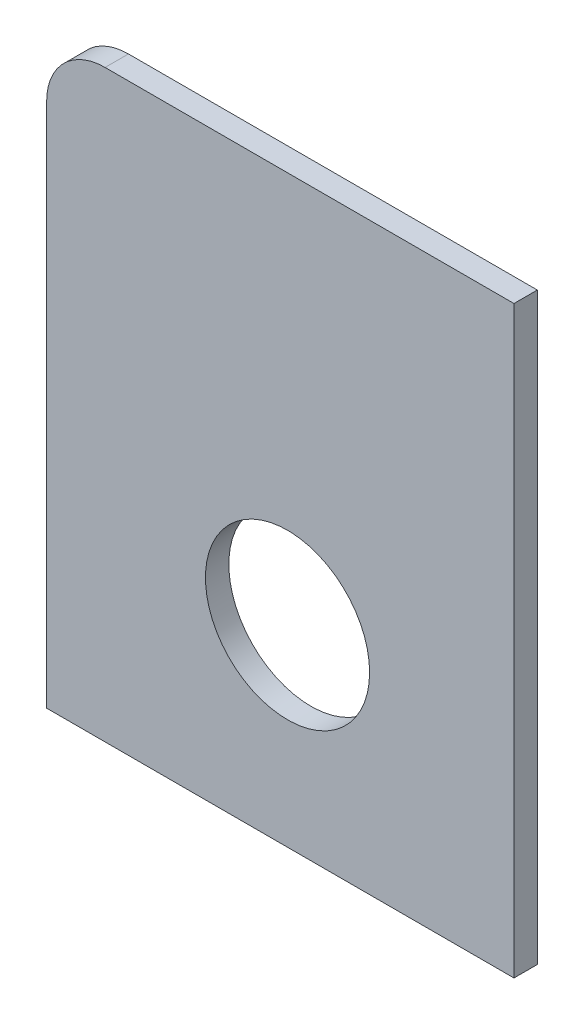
ISO-10303-21;
HEADER;
FILE_DESCRIPTION(('STEP AP214'),'2;1');
FILE_NAME('part.step','',(''),(''),'','','');
FILE_SCHEMA(('AUTOMOTIVE_DESIGN { 1 0 10303 214 1 1 1 1 }'));
ENDSEC;
DATA;
#1=APPLICATION_CONTEXT('core data for automotive mechanical design processes');
#2=APPLICATION_PROTOCOL_DEFINITION('international standard','automotive_design',2000,#1);
#3=PRODUCT_CONTEXT('',#1,'mechanical');
#4=PRODUCT('Part','Part','',(#3));
#5=PRODUCT_RELATED_PRODUCT_CATEGORY('part','',(#4));
#6=PRODUCT_DEFINITION_FORMATION('','',#4);
#7=PRODUCT_DEFINITION_CONTEXT('part definition',#1,'design');
#8=PRODUCT_DEFINITION('design','',#6,#7);
#9=PRODUCT_DEFINITION_SHAPE('','',#8);
#10=(LENGTH_UNIT() NAMED_UNIT(*) SI_UNIT(.MILLI.,.METRE.));
#11=(NAMED_UNIT(*) PLANE_ANGLE_UNIT() SI_UNIT($,.RADIAN.));
#12=(NAMED_UNIT(*) SI_UNIT($,.STERADIAN.) SOLID_ANGLE_UNIT());
#13=UNCERTAINTY_MEASURE_WITH_UNIT(LENGTH_MEASURE(1.E-05),#10,'distance_accuracy_value','');
#14=(GEOMETRIC_REPRESENTATION_CONTEXT(3) GLOBAL_UNCERTAINTY_ASSIGNED_CONTEXT((#13)) GLOBAL_UNIT_ASSIGNED_CONTEXT((#10,
#11,#12)) REPRESENTATION_CONTEXT('',''));
#15=CARTESIAN_POINT('',(0.,0.,0.));
#16=DIRECTION('',(0.,0.,1.));
#17=DIRECTION('',(1.,0.,0.));
#18=AXIS2_PLACEMENT_3D('',#15,#16,#17);
#19=CARTESIAN_POINT('',(-44.45,57.15,2.54));
#20=DIRECTION('',(0.,0.,1.));
#21=DIRECTION('',(1.,0.,0.));
#22=AXIS2_PLACEMENT_3D('',#19,#20,#21);
#23=PLANE('',#22);
#24=DIRECTION('',(0.,1.,0.));
#25=VECTOR('',#24,1.);
#26=CARTESIAN_POINT('',(0.,0.,2.54));
#27=LINE('',#26,#25);
#28=CARTESIAN_POINT('',(0.,0.,2.54));
#29=VERTEX_POINT('',#28);
#30=CARTESIAN_POINT('',(0.,63.5,2.54));
#31=VERTEX_POINT('',#30);
#32=EDGE_CURVE('E104',#29,#31,#27,.T.);
#33=ORIENTED_EDGE('',*,*,#32,.T.);
#34=DIRECTION('',(-1.,0.,0.));
#35=VECTOR('',#34,1.);
#36=CARTESIAN_POINT('',(0.,63.5,2.54));
#37=LINE('',#36,#35);
#38=CARTESIAN_POINT('',(-44.45,63.5,2.54));
#39=VERTEX_POINT('',#38);
#40=EDGE_CURVE('E87',#31,#39,#37,.T.);
#41=ORIENTED_EDGE('',*,*,#40,.T.);
#42=CARTESIAN_POINT('',(-44.45,57.15,2.54));
#43=DIRECTION('',(0.,0.,1.));
#44=DIRECTION('',(1.,0.,0.));
#45=AXIS2_PLACEMENT_3D('',#42,#43,#44);
#46=CIRCLE('',#45,6.35000000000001);
#47=CARTESIAN_POINT('',(-50.8,57.15,2.54));
#48=VERTEX_POINT('',#47);
#49=EDGE_CURVE('E107',#39,#48,#46,.T.);
#50=ORIENTED_EDGE('',*,*,#49,.T.);
#51=DIRECTION('',(0.,-1.,0.));
#52=VECTOR('',#51,1.);
#53=CARTESIAN_POINT('',(-50.8,0.,2.54));
#54=LINE('',#53,#52);
#55=CARTESIAN_POINT('',(-50.8,0.,2.54));
#56=VERTEX_POINT('',#55);
#57=EDGE_CURVE('E46',#48,#56,#54,.T.);
#58=ORIENTED_EDGE('',*,*,#57,.T.);
#59=DIRECTION('',(1.,0.,0.));
#60=VECTOR('',#59,1.);
#61=CARTESIAN_POINT('',(0.,0.,2.54));
#62=LINE('',#61,#60);
#63=EDGE_CURVE('E41',#56,#29,#62,.T.);
#64=ORIENTED_EDGE('',*,*,#63,.T.);
#65=EDGE_LOOP('',(#33,#41,#50,#58,#64));
#66=FACE_BOUND('',#65,.T.);
#67=CARTESIAN_POINT('',(-24.6167400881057,20.9242290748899,2.54));
#68=DIRECTION('',(0.,0.,1.));
#69=DIRECTION('',(1.,0.,0.));
#70=AXIS2_PLACEMENT_3D('',#67,#68,#69);
#71=CIRCLE('',#70,8.92356828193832);
#72=CARTESIAN_POINT('',(-15.6931718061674,20.9242290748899,2.54));
#73=VERTEX_POINT('',#72);
#74=EDGE_CURVE('E92',#73,#73,#71,.T.);
#75=ORIENTED_EDGE('',*,*,#74,.F.);
#76=EDGE_LOOP('',(#75));
#77=FACE_BOUND('',#76,.T.);
#78=ADVANCED_FACE('F26',(#66,#77),#23,.T.);
#79=CARTESIAN_POINT('',(-44.45,57.15,0.));
#80=DIRECTION('',(0.,0.,1.));
#81=DIRECTION('',(1.,0.,0.));
#82=AXIS2_PLACEMENT_3D('',#79,#80,#81);
#83=PLANE('',#82);
#84=DIRECTION('',(0.,1.,0.));
#85=VECTOR('',#84,1.);
#86=CARTESIAN_POINT('',(0.,0.,0.));
#87=LINE('',#86,#85);
#88=CARTESIAN_POINT('',(0.,0.,0.));
#89=VERTEX_POINT('',#88);
#90=CARTESIAN_POINT('',(0.,63.5,0.));
#91=VERTEX_POINT('',#90);
#92=EDGE_CURVE('E78',#89,#91,#87,.T.);
#93=ORIENTED_EDGE('',*,*,#92,.F.);
#94=DIRECTION('',(1.,0.,0.));
#95=VECTOR('',#94,1.);
#96=CARTESIAN_POINT('',(0.,0.,0.));
#97=LINE('',#96,#95);
#98=CARTESIAN_POINT('',(-50.8,0.,0.));
#99=VERTEX_POINT('',#98);
#100=EDGE_CURVE('E102',#99,#89,#97,.T.);
#101=ORIENTED_EDGE('',*,*,#100,.F.);
#102=DIRECTION('',(0.,-1.,0.));
#103=VECTOR('',#102,1.);
#104=CARTESIAN_POINT('',(-50.8,0.,0.));
#105=LINE('',#104,#103);
#106=CARTESIAN_POINT('',(-50.8,57.15,0.));
#107=VERTEX_POINT('',#106);
#108=EDGE_CURVE('E100',#107,#99,#105,.T.);
#109=ORIENTED_EDGE('',*,*,#108,.F.);
#110=CARTESIAN_POINT('',(-44.45,57.15,0.));
#111=DIRECTION('',(0.,0.,1.));
#112=DIRECTION('',(1.,0.,0.));
#113=AXIS2_PLACEMENT_3D('',#110,#111,#112);
#114=CIRCLE('',#113,6.35000000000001);
#115=CARTESIAN_POINT('',(-44.45,63.5,0.));
#116=VERTEX_POINT('',#115);
#117=EDGE_CURVE('E80',#116,#107,#114,.T.);
#118=ORIENTED_EDGE('',*,*,#117,.F.);
#119=DIRECTION('',(-1.,0.,0.));
#120=VECTOR('',#119,1.);
#121=CARTESIAN_POINT('',(0.,63.5,0.));
#122=LINE('',#121,#120);
#123=EDGE_CURVE('E73',#91,#116,#122,.T.);
#124=ORIENTED_EDGE('',*,*,#123,.F.);
#125=EDGE_LOOP('',(#93,#101,#109,#118,#124));
#126=FACE_BOUND('',#125,.T.);
#127=CARTESIAN_POINT('',(-24.6167400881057,20.9242290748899,0.));
#128=DIRECTION('',(0.,0.,1.));
#129=DIRECTION('',(1.,0.,0.));
#130=AXIS2_PLACEMENT_3D('',#127,#128,#129);
#131=CIRCLE('',#130,8.92356828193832);
#132=CARTESIAN_POINT('',(-15.6931718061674,20.9242290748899,0.));
#133=VERTEX_POINT('',#132);
#134=EDGE_CURVE('E95',#133,#133,#131,.T.);
#135=ORIENTED_EDGE('',*,*,#134,.T.);
#136=EDGE_LOOP('',(#135));
#137=FACE_BOUND('',#136,.T.);
#138=ADVANCED_FACE('F74',(#126,#137),#83,.F.);
#139=CARTESIAN_POINT('',(0.,0.,2.54));
#140=DIRECTION('',(-1.,0.,0.));
#141=DIRECTION('',(0.,0.,1.));
#142=AXIS2_PLACEMENT_3D('',#139,#140,#141);
#143=PLANE('',#142);
#144=ORIENTED_EDGE('',*,*,#92,.T.);
#145=DIRECTION('',(0.,0.,-1.));
#146=VECTOR('',#145,1.);
#147=CARTESIAN_POINT('',(0.,63.5,2.54));
#148=LINE('',#147,#146);
#149=EDGE_CURVE('E11',#31,#91,#148,.T.);
#150=ORIENTED_EDGE('',*,*,#149,.F.);
#151=ORIENTED_EDGE('',*,*,#32,.F.);
#152=DIRECTION('',(0.,0.,-1.));
#153=VECTOR('',#152,1.);
#154=CARTESIAN_POINT('',(0.,0.,2.54));
#155=LINE('',#154,#153);
#156=EDGE_CURVE('E91',#29,#89,#155,.T.);
#157=ORIENTED_EDGE('',*,*,#156,.T.);
#158=EDGE_LOOP('',(#144,#150,#151,#157));
#159=FACE_BOUND('',#158,.T.);
#160=ADVANCED_FACE('F28',(#159),#143,.F.);
#161=CARTESIAN_POINT('',(0.,63.5,2.54));
#162=DIRECTION('',(0.,-1.,0.));
#163=DIRECTION('',(1.,0.,0.));
#164=AXIS2_PLACEMENT_3D('',#161,#162,#163);
#165=PLANE('',#164);
#166=ORIENTED_EDGE('',*,*,#123,.T.);
#167=DIRECTION('',(0.,0.,-1.));
#168=VECTOR('',#167,1.);
#169=CARTESIAN_POINT('',(-44.45,63.5,2.54));
#170=LINE('',#169,#168);
#171=EDGE_CURVE('E34',#39,#116,#170,.T.);
#172=ORIENTED_EDGE('',*,*,#171,.F.);
#173=ORIENTED_EDGE('',*,*,#40,.F.);
#174=ORIENTED_EDGE('',*,*,#149,.T.);
#175=EDGE_LOOP('',(#166,#172,#173,#174));
#176=FACE_BOUND('',#175,.T.);
#177=ADVANCED_FACE('F86',(#176),#165,.F.);
#178=CARTESIAN_POINT('',(-44.45,57.15,2.54));
#179=DIRECTION('',(0.,0.,-1.));
#180=DIRECTION('',(-1.,0.,0.));
#181=AXIS2_PLACEMENT_3D('',#178,#179,#180);
#182=CYLINDRICAL_SURFACE('',#181,6.35000000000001);
#183=ORIENTED_EDGE('',*,*,#117,.T.);
#184=DIRECTION('',(0.,0.,-1.));
#185=VECTOR('',#184,1.);
#186=CARTESIAN_POINT('',(-50.8,57.15,2.54));
#187=LINE('',#186,#185);
#188=EDGE_CURVE('E115',#48,#107,#187,.T.);
#189=ORIENTED_EDGE('',*,*,#188,.F.);
#190=ORIENTED_EDGE('',*,*,#49,.F.);
#191=ORIENTED_EDGE('',*,*,#171,.T.);
#192=EDGE_LOOP('',(#183,#189,#190,#191));
#193=FACE_BOUND('',#192,.T.);
#194=ADVANCED_FACE('F119',(#193),#182,.T.);
#195=CARTESIAN_POINT('',(-50.8,0.,2.54));
#196=DIRECTION('',(1.,0.,0.));
#197=DIRECTION('',(0.,0.,-1.));
#198=AXIS2_PLACEMENT_3D('',#195,#196,#197);
#199=PLANE('',#198);
#200=ORIENTED_EDGE('',*,*,#108,.T.);
#201=DIRECTION('',(0.,0.,-1.));
#202=VECTOR('',#201,1.);
#203=CARTESIAN_POINT('',(-50.8,0.,2.54));
#204=LINE('',#203,#202);
#205=EDGE_CURVE('E112',#56,#99,#204,.T.);
#206=ORIENTED_EDGE('',*,*,#205,.F.);
#207=ORIENTED_EDGE('',*,*,#57,.F.);
#208=ORIENTED_EDGE('',*,*,#188,.T.);
#209=EDGE_LOOP('',(#200,#206,#207,#208));
#210=FACE_BOUND('',#209,.T.);
#211=ADVANCED_FACE('F141',(#210),#199,.F.);
#212=CARTESIAN_POINT('',(0.,0.,2.54));
#213=DIRECTION('',(0.,1.,0.));
#214=DIRECTION('',(-1.,0.,0.));
#215=AXIS2_PLACEMENT_3D('',#212,#213,#214);
#216=PLANE('',#215);
#217=ORIENTED_EDGE('',*,*,#100,.T.);
#218=ORIENTED_EDGE('',*,*,#156,.F.);
#219=ORIENTED_EDGE('',*,*,#63,.F.);
#220=ORIENTED_EDGE('',*,*,#205,.T.);
#221=EDGE_LOOP('',(#217,#218,#219,#220));
#222=FACE_BOUND('',#221,.T.);
#223=ADVANCED_FACE('F129',(#222),#216,.F.);
#224=CARTESIAN_POINT('',(-24.6167400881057,20.9242290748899,2.54));
#225=DIRECTION('',(0.,0.,-1.));
#226=DIRECTION('',(-1.,0.,0.));
#227=AXIS2_PLACEMENT_3D('',#224,#225,#226);
#228=CYLINDRICAL_SURFACE('',#227,8.92356828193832);
#229=ORIENTED_EDGE('',*,*,#74,.T.);
#230=EDGE_LOOP('',(#229));
#231=FACE_BOUND('',#230,.T.);
#232=ORIENTED_EDGE('',*,*,#134,.F.);
#233=EDGE_LOOP('',(#232));
#234=FACE_BOUND('',#233,.T.);
#235=ADVANCED_FACE('F126',(#231,#234),#228,.F.);
#236=CLOSED_SHELL('',(#78,#138,#160,#177,#194,#211,#223,#235));
#237=MANIFOLD_SOLID_BREP('B2',#236);
#238=ADVANCED_BREP_SHAPE_REPRESENTATION('',(#18,#237),#14);
#239=SHAPE_DEFINITION_REPRESENTATION(#9,#238);
ENDSEC;
END-ISO-10303-21;
